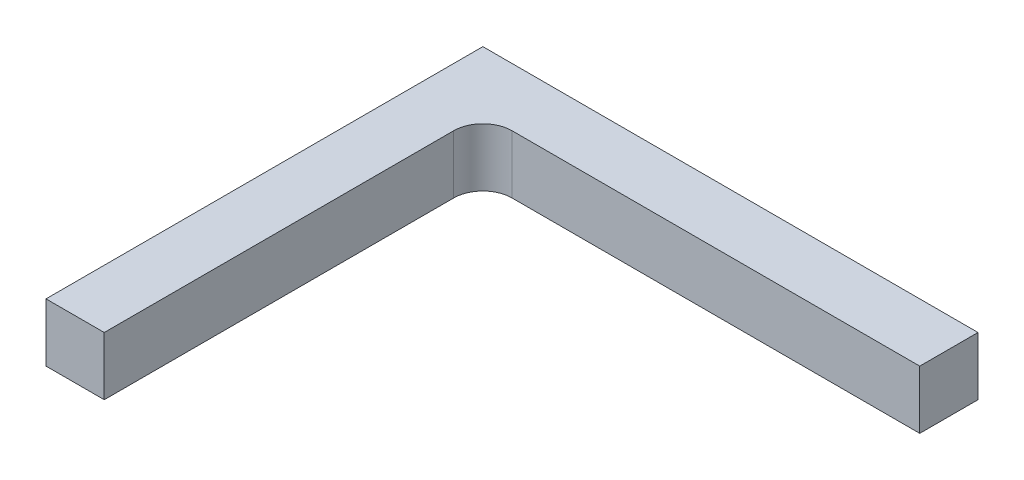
ISO-10303-21;
HEADER;
FILE_DESCRIPTION(('STEP AP214'),'2;1');
FILE_NAME('part.step','',(''),(''),'','','');
FILE_SCHEMA(('AUTOMOTIVE_DESIGN { 1 0 10303 214 1 1 1 1 }'));
ENDSEC;
DATA;
#1=APPLICATION_CONTEXT('core data for automotive mechanical design processes');
#2=APPLICATION_PROTOCOL_DEFINITION('international standard','automotive_design',2000,#1);
#3=PRODUCT_CONTEXT('',#1,'mechanical');
#4=PRODUCT('Part','Part','',(#3));
#5=PRODUCT_RELATED_PRODUCT_CATEGORY('part','',(#4));
#6=PRODUCT_DEFINITION_FORMATION('','',#4);
#7=PRODUCT_DEFINITION_CONTEXT('part definition',#1,'design');
#8=PRODUCT_DEFINITION('design','',#6,#7);
#9=PRODUCT_DEFINITION_SHAPE('','',#8);
#10=(LENGTH_UNIT() NAMED_UNIT(*) SI_UNIT(.MILLI.,.METRE.));
#11=(NAMED_UNIT(*) PLANE_ANGLE_UNIT() SI_UNIT($,.RADIAN.));
#12=(NAMED_UNIT(*) SI_UNIT($,.STERADIAN.) SOLID_ANGLE_UNIT());
#13=UNCERTAINTY_MEASURE_WITH_UNIT(LENGTH_MEASURE(1.E-05),#10,'distance_accuracy_value','');
#14=(GEOMETRIC_REPRESENTATION_CONTEXT(3) GLOBAL_UNCERTAINTY_ASSIGNED_CONTEXT((#13)) GLOBAL_UNIT_ASSIGNED_CONTEXT((#10,
#11,#12)) REPRESENTATION_CONTEXT('',''));
#15=CARTESIAN_POINT('',(0.,0.,0.));
#16=DIRECTION('',(0.,0.,1.));
#17=DIRECTION('',(1.,0.,0.));
#18=AXIS2_PLACEMENT_3D('',#15,#16,#17);
#19=CARTESIAN_POINT('',(0.,-1325.,-125.));
#20=DIRECTION('',(1.,0.,0.));
#21=DIRECTION('',(0.,1.,0.));
#22=AXIS2_PLACEMENT_3D('',#19,#20,#21);
#23=PLANE('',#22);
#24=DIRECTION('',(0.,0.,-1.));
#25=VECTOR('',#24,1.);
#26=CARTESIAN_POINT('',(0.,-1125.,-125.));
#27=LINE('',#26,#25);
#28=CARTESIAN_POINT('',(0.,-1125.,1375.));
#29=VERTEX_POINT('',#28);
#30=CARTESIAN_POINT('',(0.,-1125.,-125.));
#31=VERTEX_POINT('',#30);
#32=EDGE_CURVE('E124',#29,#31,#27,.T.);
#33=ORIENTED_EDGE('',*,*,#32,.T.);
#34=DIRECTION('',(0.,1.,0.));
#35=VECTOR('',#34,1.);
#36=CARTESIAN_POINT('',(0.,-1325.,-125.));
#37=LINE('',#36,#35);
#38=CARTESIAN_POINT('',(0.,-1325.,-125.));
#39=VERTEX_POINT('',#38);
#40=EDGE_CURVE('E103',#39,#31,#37,.T.);
#41=ORIENTED_EDGE('',*,*,#40,.F.);
#42=DIRECTION('',(0.,0.,-1.));
#43=VECTOR('',#42,1.);
#44=CARTESIAN_POINT('',(0.,-1325.,-125.));
#45=LINE('',#44,#43);
#46=CARTESIAN_POINT('',(0.,-1325.,1375.));
#47=VERTEX_POINT('',#46);
#48=EDGE_CURVE('E111',#47,#39,#45,.T.);
#49=ORIENTED_EDGE('',*,*,#48,.F.);
#50=DIRECTION('',(0.,1.,0.));
#51=VECTOR('',#50,1.);
#52=CARTESIAN_POINT('',(0.,-1325.,1375.));
#53=LINE('',#52,#51);
#54=EDGE_CURVE('E145',#47,#29,#53,.T.);
#55=ORIENTED_EDGE('',*,*,#54,.T.);
#56=EDGE_LOOP('',(#33,#41,#49,#55));
#57=FACE_BOUND('',#56,.T.);
#58=ADVANCED_FACE('F39',(#57),#23,.F.);
#59=CARTESIAN_POINT('',(1700.,-1325.,-125.));
#60=DIRECTION('',(0.,0.,1.));
#61=DIRECTION('',(-1.,0.,0.));
#62=AXIS2_PLACEMENT_3D('',#59,#60,#61);
#63=PLANE('',#62);
#64=DIRECTION('',(1.,0.,0.));
#65=VECTOR('',#64,1.);
#66=CARTESIAN_POINT('',(1700.,-1125.,-124.999999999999));
#67=LINE('',#66,#65);
#68=CARTESIAN_POINT('',(1700.,-1125.,-124.999999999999));
#69=VERTEX_POINT('',#68);
#70=EDGE_CURVE('E159',#31,#69,#67,.T.);
#71=ORIENTED_EDGE('',*,*,#70,.T.);
#72=DIRECTION('',(0.,1.,0.));
#73=VECTOR('',#72,1.);
#74=CARTESIAN_POINT('',(1700.,-1325.,-125.));
#75=LINE('',#74,#73);
#76=CARTESIAN_POINT('',(1700.,-1325.,-125.));
#77=VERTEX_POINT('',#76);
#78=EDGE_CURVE('E106',#77,#69,#75,.T.);
#79=ORIENTED_EDGE('',*,*,#78,.F.);
#80=DIRECTION('',(1.,0.,0.));
#81=VECTOR('',#80,1.);
#82=CARTESIAN_POINT('',(1700.,-1325.,-125.));
#83=LINE('',#82,#81);
#84=EDGE_CURVE('E99',#39,#77,#83,.T.);
#85=ORIENTED_EDGE('',*,*,#84,.F.);
#86=ORIENTED_EDGE('',*,*,#40,.T.);
#87=EDGE_LOOP('',(#71,#79,#85,#86));
#88=FACE_BOUND('',#87,.T.);
#89=ADVANCED_FACE('F101',(#88),#63,.F.);
#90=CARTESIAN_POINT('',(1700.,-1325.,75.));
#91=DIRECTION('',(-1.,0.,0.));
#92=DIRECTION('',(0.,-1.,0.));
#93=AXIS2_PLACEMENT_3D('',#90,#91,#92);
#94=PLANE('',#93);
#95=DIRECTION('',(0.,0.,1.));
#96=VECTOR('',#95,1.);
#97=CARTESIAN_POINT('',(1700.,-1125.,75.0000000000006));
#98=LINE('',#97,#96);
#99=CARTESIAN_POINT('',(1700.,-1125.,75.0000000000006));
#100=VERTEX_POINT('',#99);
#101=EDGE_CURVE('E156',#69,#100,#98,.T.);
#102=ORIENTED_EDGE('',*,*,#101,.T.);
#103=DIRECTION('',(0.,1.,0.));
#104=VECTOR('',#103,1.);
#105=CARTESIAN_POINT('',(1700.,-1325.,75.));
#106=LINE('',#105,#104);
#107=CARTESIAN_POINT('',(1700.,-1325.,75.));
#108=VERTEX_POINT('',#107);
#109=EDGE_CURVE('E132',#108,#100,#106,.T.);
#110=ORIENTED_EDGE('',*,*,#109,.F.);
#111=DIRECTION('',(0.,0.,1.));
#112=VECTOR('',#111,1.);
#113=CARTESIAN_POINT('',(1700.,-1325.,75.));
#114=LINE('',#113,#112);
#115=EDGE_CURVE('E110',#77,#108,#114,.T.);
#116=ORIENTED_EDGE('',*,*,#115,.F.);
#117=ORIENTED_EDGE('',*,*,#78,.T.);
#118=EDGE_LOOP('',(#102,#110,#116,#117));
#119=FACE_BOUND('',#118,.T.);
#120=ADVANCED_FACE('F208',(#119),#94,.F.);
#121=CARTESIAN_POINT('',(200.,-1325.,75.0000000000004));
#122=DIRECTION('',(0.,0.,-1.));
#123=DIRECTION('',(1.,0.,0.));
#124=AXIS2_PLACEMENT_3D('',#121,#122,#123);
#125=PLANE('',#124);
#126=DIRECTION('',(-1.,0.,0.));
#127=VECTOR('',#126,1.);
#128=CARTESIAN_POINT('',(200.,-1125.,75.0000000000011));
#129=LINE('',#128,#127);
#130=CARTESIAN_POINT('',(300.,-1125.,75.0000000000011));
#131=VERTEX_POINT('',#130);
#132=EDGE_CURVE('E153',#100,#131,#129,.T.);
#133=ORIENTED_EDGE('',*,*,#132,.T.);
#134=DIRECTION('',(0.,1.,0.));
#135=VECTOR('',#134,1.);
#136=CARTESIAN_POINT('',(300.,-1325.,75.0000000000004));
#137=LINE('',#136,#135);
#138=CARTESIAN_POINT('',(300.,-1325.,75.0000000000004));
#139=VERTEX_POINT('',#138);
#140=EDGE_CURVE('E55',#131,#139,#137,.F.);
#141=ORIENTED_EDGE('',*,*,#140,.T.);
#142=DIRECTION('',(-1.,0.,0.));
#143=VECTOR('',#142,1.);
#144=CARTESIAN_POINT('',(200.,-1325.,75.0000000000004));
#145=LINE('',#144,#143);
#146=EDGE_CURVE('E170',#108,#139,#145,.T.);
#147=ORIENTED_EDGE('',*,*,#146,.F.);
#148=ORIENTED_EDGE('',*,*,#109,.T.);
#149=EDGE_LOOP('',(#133,#141,#147,#148));
#150=FACE_BOUND('',#149,.T.);
#151=ADVANCED_FACE('F213',(#150),#125,.F.);
#152=CARTESIAN_POINT('',(200.,-1325.,1375.));
#153=DIRECTION('',(-1.,0.,0.));
#154=DIRECTION('',(0.,0.,-1.));
#155=AXIS2_PLACEMENT_3D('',#152,#153,#154);
#156=PLANE('',#155);
#157=DIRECTION('',(0.,0.,1.));
#158=VECTOR('',#157,1.);
#159=CARTESIAN_POINT('',(200.,-1325.,1375.));
#160=LINE('',#159,#158);
#161=CARTESIAN_POINT('',(200.,-1325.,175.));
#162=VERTEX_POINT('',#161);
#163=CARTESIAN_POINT('',(200.,-1325.,1375.));
#164=VERTEX_POINT('',#163);
#165=EDGE_CURVE('E167',#162,#164,#160,.T.);
#166=ORIENTED_EDGE('',*,*,#165,.F.);
#167=DIRECTION('',(0.,1.,0.));
#168=VECTOR('',#167,1.);
#169=CARTESIAN_POINT('',(200.,-1125.,175.000000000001));
#170=LINE('',#169,#168);
#171=CARTESIAN_POINT('',(200.,-1125.,175.000000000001));
#172=VERTEX_POINT('',#171);
#173=EDGE_CURVE('E126',#162,#172,#170,.T.);
#174=ORIENTED_EDGE('',*,*,#173,.T.);
#175=DIRECTION('',(0.,0.,1.));
#176=VECTOR('',#175,1.);
#177=CARTESIAN_POINT('',(200.,-1125.,1375.));
#178=LINE('',#177,#176);
#179=CARTESIAN_POINT('',(200.,-1125.,1375.));
#180=VERTEX_POINT('',#179);
#181=EDGE_CURVE('E150',#172,#180,#178,.T.);
#182=ORIENTED_EDGE('',*,*,#181,.T.);
#183=DIRECTION('',(0.,1.,0.));
#184=VECTOR('',#183,1.);
#185=CARTESIAN_POINT('',(200.,-1325.,1375.));
#186=LINE('',#185,#184);
#187=EDGE_CURVE('E141',#164,#180,#186,.T.);
#188=ORIENTED_EDGE('',*,*,#187,.F.);
#189=EDGE_LOOP('',(#166,#174,#182,#188));
#190=FACE_BOUND('',#189,.T.);
#191=ADVANCED_FACE('F217',(#190),#156,.F.);
#192=CARTESIAN_POINT('',(0.,-1325.,1375.));
#193=DIRECTION('',(0.,0.,-1.));
#194=DIRECTION('',(0.,1.,0.));
#195=AXIS2_PLACEMENT_3D('',#192,#193,#194);
#196=PLANE('',#195);
#197=DIRECTION('',(-1.,0.,0.));
#198=VECTOR('',#197,1.);
#199=CARTESIAN_POINT('',(0.,-1125.,1375.));
#200=LINE('',#199,#198);
#201=EDGE_CURVE('E121',#180,#29,#200,.T.);
#202=ORIENTED_EDGE('',*,*,#201,.T.);
#203=ORIENTED_EDGE('',*,*,#54,.F.);
#204=DIRECTION('',(-1.,0.,0.));
#205=VECTOR('',#204,1.);
#206=CARTESIAN_POINT('',(0.,-1325.,1375.));
#207=LINE('',#206,#205);
#208=EDGE_CURVE('E116',#164,#47,#207,.T.);
#209=ORIENTED_EDGE('',*,*,#208,.F.);
#210=ORIENTED_EDGE('',*,*,#187,.T.);
#211=EDGE_LOOP('',(#202,#203,#209,#210));
#212=FACE_BOUND('',#211,.T.);
#213=ADVANCED_FACE('F220',(#212),#196,.F.);
#214=CARTESIAN_POINT('',(0.,-1325.,1375.));
#215=DIRECTION('',(0.,1.,0.));
#216=DIRECTION('',(-1.,0.,0.));
#217=AXIS2_PLACEMENT_3D('',#214,#215,#216);
#218=PLANE('',#217);
#219=CARTESIAN_POINT('',(100.,-1325.,875.));
#220=DIRECTION('',(0.,1.,0.));
#221=DIRECTION('',(-1.,0.,0.));
#222=AXIS2_PLACEMENT_3D('',#219,#220,#221);
#223=CIRCLE('',#222,40.);
#224=CARTESIAN_POINT('',(60.0000000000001,-1325.,875.));
#225=VERTEX_POINT('',#224);
#226=EDGE_CURVE('E183',#225,#225,#223,.T.);
#227=ORIENTED_EDGE('',*,*,#226,.T.);
#228=EDGE_LOOP('',(#227));
#229=FACE_BOUND('',#228,.T.);
#230=CARTESIAN_POINT('',(100.,-1325.,475.));
#231=DIRECTION('',(0.,1.,0.));
#232=DIRECTION('',(-1.,0.,0.));
#233=AXIS2_PLACEMENT_3D('',#230,#231,#232);
#234=CIRCLE('',#233,40.);
#235=CARTESIAN_POINT('',(60.0000000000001,-1325.,475.));
#236=VERTEX_POINT('',#235);
#237=EDGE_CURVE('E175',#236,#236,#234,.T.);
#238=ORIENTED_EDGE('',*,*,#237,.T.);
#239=EDGE_LOOP('',(#238));
#240=FACE_BOUND('',#239,.T.);
#241=ORIENTED_EDGE('',*,*,#48,.T.);
#242=ORIENTED_EDGE('',*,*,#84,.T.);
#243=ORIENTED_EDGE('',*,*,#115,.T.);
#244=ORIENTED_EDGE('',*,*,#146,.T.);
#245=CARTESIAN_POINT('',(300.,-1325.,175.));
#246=DIRECTION('',(0.,1.,0.));
#247=DIRECTION('',(-1.,0.,0.));
#248=AXIS2_PLACEMENT_3D('',#245,#246,#247);
#249=CIRCLE('',#248,100.);
#250=EDGE_CURVE('E11',#139,#162,#249,.T.);
#251=ORIENTED_EDGE('',*,*,#250,.T.);
#252=ORIENTED_EDGE('',*,*,#165,.T.);
#253=ORIENTED_EDGE('',*,*,#208,.T.);
#254=EDGE_LOOP('',(#241,#242,#243,#244,#251,#252,#253));
#255=FACE_BOUND('',#254,.T.);
#256=ADVANCED_FACE('F114',(#229,#240,#255),#218,.F.);
#257=CARTESIAN_POINT('',(0.,-1125.,1375.));
#258=DIRECTION('',(0.,1.,0.));
#259=DIRECTION('',(-1.,0.,0.));
#260=AXIS2_PLACEMENT_3D('',#257,#258,#259);
#261=PLANE('',#260);
#262=ORIENTED_EDGE('',*,*,#32,.F.);
#263=ORIENTED_EDGE('',*,*,#201,.F.);
#264=ORIENTED_EDGE('',*,*,#181,.F.);
#265=CARTESIAN_POINT('',(300.,-1125.,175.000000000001));
#266=DIRECTION('',(0.,1.,0.));
#267=DIRECTION('',(-1.,0.,0.));
#268=AXIS2_PLACEMENT_3D('',#265,#266,#267);
#269=CIRCLE('',#268,100.);
#270=EDGE_CURVE('E48',#172,#131,#269,.F.);
#271=ORIENTED_EDGE('',*,*,#270,.T.);
#272=ORIENTED_EDGE('',*,*,#132,.F.);
#273=ORIENTED_EDGE('',*,*,#101,.F.);
#274=ORIENTED_EDGE('',*,*,#70,.F.);
#275=EDGE_LOOP('',(#262,#263,#264,#271,#272,#273,#274));
#276=FACE_BOUND('',#275,.T.);
#277=ADVANCED_FACE('F225',(#276),#261,.T.);
#278=CARTESIAN_POINT('',(100.,-1375.,475.));
#279=DIRECTION('',(0.,1.,0.));
#280=DIRECTION('',(-1.,0.,0.));
#281=AXIS2_PLACEMENT_3D('',#278,#279,#280);
#282=CYLINDRICAL_SURFACE('',#281,40.);
#283=CARTESIAN_POINT('',(100.,-1375.,475.));
#284=DIRECTION('',(0.,1.,0.));
#285=DIRECTION('',(-1.,0.,0.));
#286=AXIS2_PLACEMENT_3D('',#283,#284,#285);
#287=CIRCLE('',#286,40.);
#288=CARTESIAN_POINT('',(60.0000000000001,-1375.,475.));
#289=VERTEX_POINT('',#288);
#290=EDGE_CURVE('E164',#289,#289,#287,.T.);
#291=ORIENTED_EDGE('',*,*,#290,.T.);
#292=EDGE_LOOP('',(#291));
#293=FACE_BOUND('',#292,.T.);
#294=ORIENTED_EDGE('',*,*,#237,.F.);
#295=EDGE_LOOP('',(#294));
#296=FACE_BOUND('',#295,.T.);
#297=ADVANCED_FACE('F228',(#293,#296),#282,.T.);
#298=CARTESIAN_POINT('',(100.,-1375.,475.));
#299=DIRECTION('',(0.,1.,0.));
#300=DIRECTION('',(-1.,0.,0.));
#301=AXIS2_PLACEMENT_3D('',#298,#299,#300);
#302=PLANE('',#301);
#303=ORIENTED_EDGE('',*,*,#290,.F.);
#304=EDGE_LOOP('',(#303));
#305=FACE_BOUND('',#304,.T.);
#306=ADVANCED_FACE('F202',(#305),#302,.F.);
#307=CARTESIAN_POINT('',(100.,-1375.,875.));
#308=DIRECTION('',(0.,1.,0.));
#309=DIRECTION('',(-1.,0.,0.));
#310=AXIS2_PLACEMENT_3D('',#307,#308,#309);
#311=CYLINDRICAL_SURFACE('',#310,40.);
#312=CARTESIAN_POINT('',(100.,-1375.,875.));
#313=DIRECTION('',(0.,1.,0.));
#314=DIRECTION('',(-1.,0.,0.));
#315=AXIS2_PLACEMENT_3D('',#312,#313,#314);
#316=CIRCLE('',#315,40.);
#317=CARTESIAN_POINT('',(60.0000000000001,-1375.,875.));
#318=VERTEX_POINT('',#317);
#319=EDGE_CURVE('E179',#318,#318,#316,.T.);
#320=ORIENTED_EDGE('',*,*,#319,.T.);
#321=EDGE_LOOP('',(#320));
#322=FACE_BOUND('',#321,.T.);
#323=ORIENTED_EDGE('',*,*,#226,.F.);
#324=EDGE_LOOP('',(#323));
#325=FACE_BOUND('',#324,.T.);
#326=ADVANCED_FACE('F191',(#322,#325),#311,.T.);
#327=CARTESIAN_POINT('',(100.,-1375.,875.));
#328=DIRECTION('',(0.,1.,0.));
#329=DIRECTION('',(-1.,0.,0.));
#330=AXIS2_PLACEMENT_3D('',#327,#328,#329);
#331=PLANE('',#330);
#332=ORIENTED_EDGE('',*,*,#319,.F.);
#333=EDGE_LOOP('',(#332));
#334=FACE_BOUND('',#333,.T.);
#335=ADVANCED_FACE('F194',(#334),#331,.F.);
#336=CARTESIAN_POINT('',(300.,-1325.,175.));
#337=DIRECTION('',(0.,-1.,0.));
#338=DIRECTION('',(1.,0.,0.));
#339=AXIS2_PLACEMENT_3D('',#336,#337,#338);
#340=CYLINDRICAL_SURFACE('',#339,100.);
#341=ORIENTED_EDGE('',*,*,#250,.F.);
#342=ORIENTED_EDGE('',*,*,#140,.F.);
#343=ORIENTED_EDGE('',*,*,#270,.F.);
#344=ORIENTED_EDGE('',*,*,#173,.F.);
#345=EDGE_LOOP('',(#341,#342,#343,#344));
#346=FACE_BOUND('',#345,.T.);
#347=ADVANCED_FACE('F41',(#346),#340,.F.);
#348=CLOSED_SHELL('',(#58,#89,#120,#151,#191,#213,#256,#277,#297,#306,#326,#335,#347));
#349=MANIFOLD_SOLID_BREP('B2',#348);
#350=ADVANCED_BREP_SHAPE_REPRESENTATION('',(#18,#349),#14);
#351=SHAPE_DEFINITION_REPRESENTATION(#9,#350);
ENDSEC;
END-ISO-10303-21;
